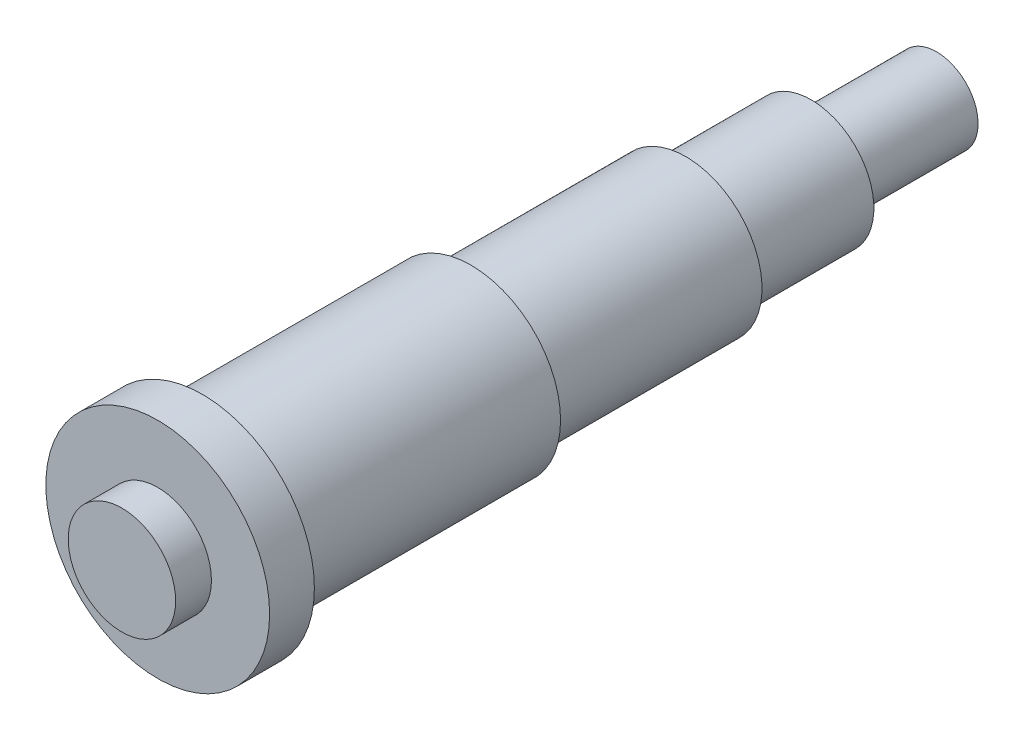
ISO-10303-21;
HEADER;
FILE_DESCRIPTION(('STEP AP214'),'2;1');
FILE_NAME('part.step','',(''),(''),'','','');
FILE_SCHEMA(('AUTOMOTIVE_DESIGN { 1 0 10303 214 1 1 1 1 }'));
ENDSEC;
DATA;
#1=APPLICATION_CONTEXT('core data for automotive mechanical design processes');
#2=APPLICATION_PROTOCOL_DEFINITION('international standard','automotive_design',2000,#1);
#3=PRODUCT_CONTEXT('',#1,'mechanical');
#4=PRODUCT('Part','Part','',(#3));
#5=PRODUCT_RELATED_PRODUCT_CATEGORY('part','',(#4));
#6=PRODUCT_DEFINITION_FORMATION('','',#4);
#7=PRODUCT_DEFINITION_CONTEXT('part definition',#1,'design');
#8=PRODUCT_DEFINITION('design','',#6,#7);
#9=PRODUCT_DEFINITION_SHAPE('','',#8);
#10=(LENGTH_UNIT() NAMED_UNIT(*) SI_UNIT(.MILLI.,.METRE.));
#11=(NAMED_UNIT(*) PLANE_ANGLE_UNIT() SI_UNIT($,.RADIAN.));
#12=(NAMED_UNIT(*) SI_UNIT($,.STERADIAN.) SOLID_ANGLE_UNIT());
#13=UNCERTAINTY_MEASURE_WITH_UNIT(LENGTH_MEASURE(1.E-05),#10,'distance_accuracy_value','');
#14=(GEOMETRIC_REPRESENTATION_CONTEXT(3) GLOBAL_UNCERTAINTY_ASSIGNED_CONTEXT((#13)) GLOBAL_UNIT_ASSIGNED_CONTEXT((#10,
#11,#12)) REPRESENTATION_CONTEXT('',''));
#15=CARTESIAN_POINT('',(0.,0.,0.));
#16=DIRECTION('',(0.,0.,1.));
#17=DIRECTION('',(1.,0.,0.));
#18=AXIS2_PLACEMENT_3D('',#15,#16,#17);
#19=CARTESIAN_POINT('',(0.,0.,5.));
#20=DIRECTION('',(0.,0.,-1.));
#21=DIRECTION('',(-1.,0.,0.));
#22=AXIS2_PLACEMENT_3D('',#19,#20,#21);
#23=CYLINDRICAL_SURFACE('',#22,12.5);
#24=CARTESIAN_POINT('',(0.,0.,5.));
#25=DIRECTION('',(0.,0.,1.));
#26=DIRECTION('',(1.,0.,0.));
#27=AXIS2_PLACEMENT_3D('',#24,#25,#26);
#28=CIRCLE('',#27,12.5);
#29=CARTESIAN_POINT('',(12.5,0.,5.));
#30=VERTEX_POINT('',#29);
#31=EDGE_CURVE('E36',#30,#30,#28,.T.);
#32=ORIENTED_EDGE('',*,*,#31,.F.);
#33=EDGE_LOOP('',(#32));
#34=FACE_BOUND('',#33,.T.);
#35=CARTESIAN_POINT('',(0.,0.,0.));
#36=DIRECTION('',(0.,0.,1.));
#37=DIRECTION('',(1.,0.,0.));
#38=AXIS2_PLACEMENT_3D('',#35,#36,#37);
#39=CIRCLE('',#38,12.5);
#40=CARTESIAN_POINT('',(12.5,0.,0.));
#41=VERTEX_POINT('',#40);
#42=EDGE_CURVE('E40',#41,#41,#39,.T.);
#43=ORIENTED_EDGE('',*,*,#42,.T.);
#44=EDGE_LOOP('',(#43));
#45=FACE_BOUND('',#44,.T.);
#46=ADVANCED_FACE('F30',(#34,#45),#23,.T.);
#47=CARTESIAN_POINT('',(0.,0.,5.));
#48=DIRECTION('',(0.,0.,1.));
#49=DIRECTION('',(1.,0.,0.));
#50=AXIS2_PLACEMENT_3D('',#47,#48,#49);
#51=PLANE('',#50);
#52=CARTESIAN_POINT('',(0.,0.,5.));
#53=DIRECTION('',(0.,0.,1.));
#54=DIRECTION('',(1.,0.,0.));
#55=AXIS2_PLACEMENT_3D('',#52,#53,#54);
#56=CIRCLE('',#55,6.);
#57=CARTESIAN_POINT('',(6.,0.,5.));
#58=VERTEX_POINT('',#57);
#59=EDGE_CURVE('E47',#58,#58,#56,.T.);
#60=ORIENTED_EDGE('',*,*,#59,.F.);
#61=EDGE_LOOP('',(#60));
#62=FACE_BOUND('',#61,.T.);
#63=ORIENTED_EDGE('',*,*,#31,.T.);
#64=EDGE_LOOP('',(#63));
#65=FACE_BOUND('',#64,.T.);
#66=ADVANCED_FACE('F123',(#62,#65),#51,.T.);
#67=CARTESIAN_POINT('',(0.,0.,0.));
#68=DIRECTION('',(0.,0.,1.));
#69=DIRECTION('',(1.,0.,0.));
#70=AXIS2_PLACEMENT_3D('',#67,#68,#69);
#71=PLANE('',#70);
#72=CARTESIAN_POINT('',(0.,0.,0.));
#73=DIRECTION('',(0.,0.,1.));
#74=DIRECTION('',(1.,0.,0.));
#75=AXIS2_PLACEMENT_3D('',#72,#73,#74);
#76=CIRCLE('',#75,10.);
#77=CARTESIAN_POINT('',(10.,0.,0.));
#78=VERTEX_POINT('',#77);
#79=EDGE_CURVE('E10',#78,#78,#76,.F.);
#80=ORIENTED_EDGE('',*,*,#79,.F.);
#81=EDGE_LOOP('',(#80));
#82=FACE_BOUND('',#81,.T.);
#83=ORIENTED_EDGE('',*,*,#42,.F.);
#84=EDGE_LOOP('',(#83));
#85=FACE_BOUND('',#84,.T.);
#86=ADVANCED_FACE('F128',(#82,#85),#71,.F.);
#87=CARTESIAN_POINT('',(0.,0.,9.));
#88=DIRECTION('',(0.,0.,-1.));
#89=DIRECTION('',(-1.,0.,0.));
#90=AXIS2_PLACEMENT_3D('',#87,#88,#89);
#91=CYLINDRICAL_SURFACE('',#90,6.);
#92=CARTESIAN_POINT('',(0.,0.,9.));
#93=DIRECTION('',(0.,0.,1.));
#94=DIRECTION('',(1.,0.,0.));
#95=AXIS2_PLACEMENT_3D('',#92,#93,#94);
#96=CIRCLE('',#95,6.);
#97=CARTESIAN_POINT('',(6.,0.,9.));
#98=VERTEX_POINT('',#97);
#99=EDGE_CURVE('E45',#98,#98,#96,.T.);
#100=ORIENTED_EDGE('',*,*,#99,.F.);
#101=EDGE_LOOP('',(#100));
#102=FACE_BOUND('',#101,.T.);
#103=ORIENTED_EDGE('',*,*,#59,.T.);
#104=EDGE_LOOP('',(#103));
#105=FACE_BOUND('',#104,.T.);
#106=ADVANCED_FACE('F119',(#102,#105),#91,.T.);
#107=CARTESIAN_POINT('',(0.,0.,9.));
#108=DIRECTION('',(0.,0.,1.));
#109=DIRECTION('',(1.,0.,0.));
#110=AXIS2_PLACEMENT_3D('',#107,#108,#109);
#111=PLANE('',#110);
#112=ORIENTED_EDGE('',*,*,#99,.T.);
#113=EDGE_LOOP('',(#112));
#114=FACE_BOUND('',#113,.T.);
#115=ADVANCED_FACE('F114',(#114),#111,.T.);
#116=CARTESIAN_POINT('',(0.,0.,-30.));
#117=DIRECTION('',(0.,0.,1.));
#118=DIRECTION('',(1.,0.,0.));
#119=AXIS2_PLACEMENT_3D('',#116,#117,#118);
#120=CYLINDRICAL_SURFACE('',#119,10.);
#121=CARTESIAN_POINT('',(0.,0.,-30.));
#122=DIRECTION('',(0.,0.,-1.));
#123=DIRECTION('',(-1.,0.,0.));
#124=AXIS2_PLACEMENT_3D('',#121,#122,#123);
#125=CIRCLE('',#124,10.);
#126=CARTESIAN_POINT('',(-10.,0.,-30.));
#127=VERTEX_POINT('',#126);
#128=EDGE_CURVE('E50',#127,#127,#125,.T.);
#129=ORIENTED_EDGE('',*,*,#128,.F.);
#130=EDGE_LOOP('',(#129));
#131=FACE_BOUND('',#130,.T.);
#132=ORIENTED_EDGE('',*,*,#79,.T.);
#133=EDGE_LOOP('',(#132));
#134=FACE_BOUND('',#133,.T.);
#135=ADVANCED_FACE('F109',(#131,#134),#120,.T.);
#136=CARTESIAN_POINT('',(0.,0.,-30.));
#137=DIRECTION('',(0.,0.,-1.));
#138=DIRECTION('',(-1.,0.,0.));
#139=AXIS2_PLACEMENT_3D('',#136,#137,#138);
#140=PLANE('',#139);
#141=CARTESIAN_POINT('',(0.,0.,-30.));
#142=DIRECTION('',(0.,0.,-1.));
#143=DIRECTION('',(-1.,0.,0.));
#144=AXIS2_PLACEMENT_3D('',#141,#142,#143);
#145=CIRCLE('',#144,8.5);
#146=CARTESIAN_POINT('',(-8.5,0.,-30.));
#147=VERTEX_POINT('',#146);
#148=EDGE_CURVE('E56',#147,#147,#145,.T.);
#149=ORIENTED_EDGE('',*,*,#148,.F.);
#150=EDGE_LOOP('',(#149));
#151=FACE_BOUND('',#150,.T.);
#152=ORIENTED_EDGE('',*,*,#128,.T.);
#153=EDGE_LOOP('',(#152));
#154=FACE_BOUND('',#153,.T.);
#155=ADVANCED_FACE('F103',(#151,#154),#140,.T.);
#156=CARTESIAN_POINT('',(0.,0.,-54.));
#157=DIRECTION('',(0.,0.,1.));
#158=DIRECTION('',(1.,0.,0.));
#159=AXIS2_PLACEMENT_3D('',#156,#157,#158);
#160=CYLINDRICAL_SURFACE('',#159,8.5);
#161=CARTESIAN_POINT('',(0.,0.,-54.));
#162=DIRECTION('',(0.,0.,-1.));
#163=DIRECTION('',(-1.,0.,0.));
#164=AXIS2_PLACEMENT_3D('',#161,#162,#163);
#165=CIRCLE('',#164,8.5);
#166=CARTESIAN_POINT('',(-8.5,0.,-54.));
#167=VERTEX_POINT('',#166);
#168=EDGE_CURVE('E55',#167,#167,#165,.T.);
#169=ORIENTED_EDGE('',*,*,#168,.F.);
#170=EDGE_LOOP('',(#169));
#171=FACE_BOUND('',#170,.T.);
#172=ORIENTED_EDGE('',*,*,#148,.T.);
#173=EDGE_LOOP('',(#172));
#174=FACE_BOUND('',#173,.T.);
#175=ADVANCED_FACE('F97',(#171,#174),#160,.T.);
#176=CARTESIAN_POINT('',(0.,0.,-54.));
#177=DIRECTION('',(0.,0.,-1.));
#178=DIRECTION('',(-1.,0.,0.));
#179=AXIS2_PLACEMENT_3D('',#176,#177,#178);
#180=PLANE('',#179);
#181=CARTESIAN_POINT('',(0.,0.,-54.));
#182=DIRECTION('',(0.,0.,-1.));
#183=DIRECTION('',(-1.,0.,0.));
#184=AXIS2_PLACEMENT_3D('',#181,#182,#183);
#185=CIRCLE('',#184,7.);
#186=CARTESIAN_POINT('',(-7.,0.,-54.));
#187=VERTEX_POINT('',#186);
#188=EDGE_CURVE('E62',#187,#187,#185,.T.);
#189=ORIENTED_EDGE('',*,*,#188,.F.);
#190=EDGE_LOOP('',(#189));
#191=FACE_BOUND('',#190,.T.);
#192=ORIENTED_EDGE('',*,*,#168,.T.);
#193=EDGE_LOOP('',(#192));
#194=FACE_BOUND('',#193,.T.);
#195=ADVANCED_FACE('F91',(#191,#194),#180,.T.);
#196=CARTESIAN_POINT('',(0.,0.,-68.));
#197=DIRECTION('',(0.,0.,1.));
#198=DIRECTION('',(1.,0.,0.));
#199=AXIS2_PLACEMENT_3D('',#196,#197,#198);
#200=CYLINDRICAL_SURFACE('',#199,7.);
#201=CARTESIAN_POINT('',(0.,0.,-68.));
#202=DIRECTION('',(0.,0.,-1.));
#203=DIRECTION('',(-1.,0.,0.));
#204=AXIS2_PLACEMENT_3D('',#201,#202,#203);
#205=CIRCLE('',#204,7.);
#206=CARTESIAN_POINT('',(-7.,0.,-68.));
#207=VERTEX_POINT('',#206);
#208=EDGE_CURVE('E59',#207,#207,#205,.T.);
#209=ORIENTED_EDGE('',*,*,#208,.F.);
#210=EDGE_LOOP('',(#209));
#211=FACE_BOUND('',#210,.T.);
#212=ORIENTED_EDGE('',*,*,#188,.T.);
#213=EDGE_LOOP('',(#212));
#214=FACE_BOUND('',#213,.T.);
#215=ADVANCED_FACE('F85',(#211,#214),#200,.T.);
#216=CARTESIAN_POINT('',(0.,0.,-68.));
#217=DIRECTION('',(0.,0.,-1.));
#218=DIRECTION('',(-1.,0.,0.));
#219=AXIS2_PLACEMENT_3D('',#216,#217,#218);
#220=PLANE('',#219);
#221=CARTESIAN_POINT('',(0.,0.,-68.));
#222=DIRECTION('',(0.,0.,-1.));
#223=DIRECTION('',(-1.,0.,0.));
#224=AXIS2_PLACEMENT_3D('',#221,#222,#223);
#225=CIRCLE('',#224,4.64036917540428);
#226=CARTESIAN_POINT('',(-4.64036917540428,0.,-68.));
#227=VERTEX_POINT('',#226);
#228=EDGE_CURVE('E68',#227,#227,#225,.T.);
#229=ORIENTED_EDGE('',*,*,#228,.F.);
#230=EDGE_LOOP('',(#229));
#231=FACE_BOUND('',#230,.T.);
#232=ORIENTED_EDGE('',*,*,#208,.T.);
#233=EDGE_LOOP('',(#232));
#234=FACE_BOUND('',#233,.T.);
#235=ADVANCED_FACE('F79',(#231,#234),#220,.T.);
#236=CARTESIAN_POINT('',(0.,0.,-82.));
#237=DIRECTION('',(0.,0.,1.));
#238=DIRECTION('',(1.,0.,0.));
#239=AXIS2_PLACEMENT_3D('',#236,#237,#238);
#240=CYLINDRICAL_SURFACE('',#239,4.64036917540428);
#241=CARTESIAN_POINT('',(0.,0.,-82.));
#242=DIRECTION('',(0.,0.,-1.));
#243=DIRECTION('',(-1.,0.,0.));
#244=AXIS2_PLACEMENT_3D('',#241,#242,#243);
#245=CIRCLE('',#244,4.64036917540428);
#246=CARTESIAN_POINT('',(-4.64036917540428,0.,-82.));
#247=VERTEX_POINT('',#246);
#248=EDGE_CURVE('E65',#247,#247,#245,.T.);
#249=ORIENTED_EDGE('',*,*,#248,.F.);
#250=EDGE_LOOP('',(#249));
#251=FACE_BOUND('',#250,.T.);
#252=ORIENTED_EDGE('',*,*,#228,.T.);
#253=EDGE_LOOP('',(#252));
#254=FACE_BOUND('',#253,.T.);
#255=ADVANCED_FACE('F76',(#251,#254),#240,.T.);
#256=CARTESIAN_POINT('',(0.,0.,-82.));
#257=DIRECTION('',(0.,0.,-1.));
#258=DIRECTION('',(-1.,0.,0.));
#259=AXIS2_PLACEMENT_3D('',#256,#257,#258);
#260=PLANE('',#259);
#261=ORIENTED_EDGE('',*,*,#248,.T.);
#262=EDGE_LOOP('',(#261));
#263=FACE_BOUND('',#262,.T.);
#264=ADVANCED_FACE('F74',(#263),#260,.T.);
#265=CLOSED_SHELL('',(#46,#66,#86,#106,#115,#135,#155,#175,#195,#215,#235,#255,#264));
#266=MANIFOLD_SOLID_BREP('B2',#265);
#267=ADVANCED_BREP_SHAPE_REPRESENTATION('',(#18,#266),#14);
#268=SHAPE_DEFINITION_REPRESENTATION(#9,#267);
ENDSEC;
END-ISO-10303-21;
